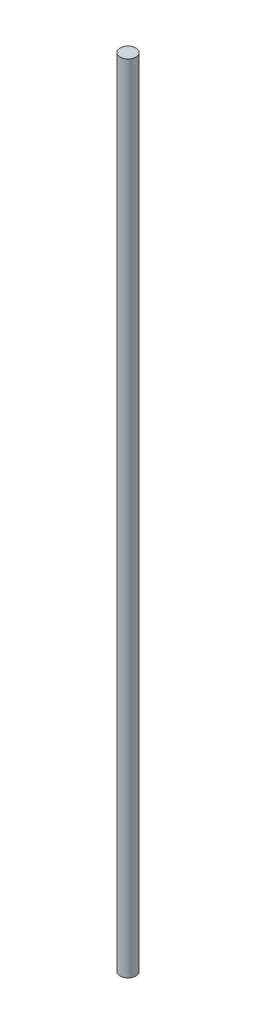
from build123d import *

# Parameters (mm, degrees)
SKETCH1_R           = 3.175
BOSS_EXTRUDE1_DEPTH = 317.5


with BuildPart() as part:
    # Sketch1 → Boss-Extrude1 (new body)
    with BuildSketch(Plane(origin=(0, 0, 0), x_dir=(1, 0, 0), z_dir=(0, 1, 0))):
        with Locations(Location((0, 0, 0), (0, 0, 90))):
            Circle(SKETCH1_R)
    extrude(amount=BOSS_EXTRUDE1_DEPTH)


solid = part.part
